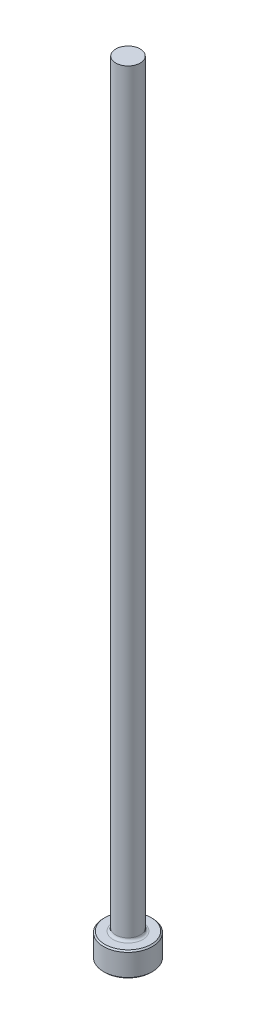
from build123d import *

# Parameters (mm, degrees)
CHAMFER1_SIZE = 0.254
FILLET1_R     = 0.508


with BuildPart() as part:
    # Sketch1 → Revolve1 (revolve)
    with BuildSketch(Plane.XY, mode=Mode.PRIVATE) as revolve1_sk:
        Polygon((0, 0), (-4.7625, 0), (-4.7625, 4.7498), (-2.38125, 4.7498), (-2.38125, 152.4), (0, 152.4), align=None)
    revolve(revolve1_sk.sketch.rotate(Axis((0, 259.958771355, 0), (0, -1, 0)), 270), axis=Axis((0, 259.958771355, 0), (0, -1, 0)))

    # Chamfer1
    chamfer1_edges = [part.edges().sort_by_distance(p)[0] for p in [
        (0, 4.7498, -4.7625),
        (0, 0, -4.7625),
    ]]
    chamfer(chamfer1_edges, length=CHAMFER1_SIZE)

    # Fillet1
    fillet1_edges = [part.edges().sort_by_distance(p)[0] for p in [
        (0, 4.7498, -2.38125),
    ]]
    fillet(fillet1_edges, radius=FILLET1_R)


solid = part.part
